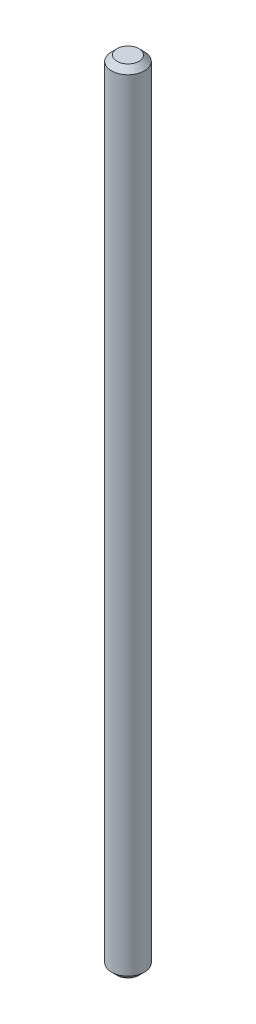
ISO-10303-21;
HEADER;
FILE_DESCRIPTION(('STEP AP214'),'2;1');
FILE_NAME('part.step','',(''),(''),'','','');
FILE_SCHEMA(('AUTOMOTIVE_DESIGN { 1 0 10303 214 1 1 1 1 }'));
ENDSEC;
DATA;
#1=APPLICATION_CONTEXT('core data for automotive mechanical design processes');
#2=APPLICATION_PROTOCOL_DEFINITION('international standard','automotive_design',2000,#1);
#3=PRODUCT_CONTEXT('',#1,'mechanical');
#4=PRODUCT('Part','Part','',(#3));
#5=PRODUCT_RELATED_PRODUCT_CATEGORY('part','',(#4));
#6=PRODUCT_DEFINITION_FORMATION('','',#4);
#7=PRODUCT_DEFINITION_CONTEXT('part definition',#1,'design');
#8=PRODUCT_DEFINITION('design','',#6,#7);
#9=PRODUCT_DEFINITION_SHAPE('','',#8);
#10=(LENGTH_UNIT() NAMED_UNIT(*) SI_UNIT(.MILLI.,.METRE.));
#11=(NAMED_UNIT(*) PLANE_ANGLE_UNIT() SI_UNIT($,.RADIAN.));
#12=(NAMED_UNIT(*) SI_UNIT($,.STERADIAN.) SOLID_ANGLE_UNIT());
#13=UNCERTAINTY_MEASURE_WITH_UNIT(LENGTH_MEASURE(1.E-05),#10,'distance_accuracy_value','');
#14=(GEOMETRIC_REPRESENTATION_CONTEXT(3) GLOBAL_UNCERTAINTY_ASSIGNED_CONTEXT((#13)) GLOBAL_UNIT_ASSIGNED_CONTEXT((#10,
#11,#12)) REPRESENTATION_CONTEXT('',''));
#15=CARTESIAN_POINT('',(0.,0.,0.));
#16=DIRECTION('',(0.,0.,1.));
#17=DIRECTION('',(1.,0.,0.));
#18=AXIS2_PLACEMENT_3D('',#15,#16,#17);
#19=CARTESIAN_POINT('',(0.,72.,0.));
#20=DIRECTION('',(0.,-1.,0.));
#21=DIRECTION('',(0.,0.,-1.));
#22=AXIS2_PLACEMENT_3D('',#19,#20,#21);
#23=CYLINDRICAL_SURFACE('',#22,1.5);
#24=CARTESIAN_POINT('',(0.,0.499999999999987,0.));
#25=DIRECTION('',(0.,1.,0.));
#26=DIRECTION('',(0.,0.,1.));
#27=AXIS2_PLACEMENT_3D('',#24,#25,#26);
#28=CIRCLE('',#27,1.5);
#29=CARTESIAN_POINT('',(0.,0.499999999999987,1.5));
#30=VERTEX_POINT('',#29);
#31=EDGE_CURVE('E40',#30,#30,#28,.T.);
#32=ORIENTED_EDGE('',*,*,#31,.T.);
#33=EDGE_LOOP('',(#32));
#34=FACE_BOUND('',#33,.T.);
#35=CARTESIAN_POINT('',(0.,71.5,0.));
#36=DIRECTION('',(0.,1.,0.));
#37=DIRECTION('',(0.,0.,1.));
#38=AXIS2_PLACEMENT_3D('',#35,#36,#37);
#39=CIRCLE('',#38,1.5);
#40=CARTESIAN_POINT('',(0.,71.5,1.5));
#41=VERTEX_POINT('',#40);
#42=EDGE_CURVE('E44',#41,#41,#39,.F.);
#43=ORIENTED_EDGE('',*,*,#42,.T.);
#44=EDGE_LOOP('',(#43));
#45=FACE_BOUND('',#44,.T.);
#46=ADVANCED_FACE('F29',(#34,#45),#23,.T.);
#47=CARTESIAN_POINT('',(0.,72.,0.));
#48=DIRECTION('',(0.,1.,0.));
#49=DIRECTION('',(0.,0.,1.));
#50=AXIS2_PLACEMENT_3D('',#47,#48,#49);
#51=PLANE('',#50);
#52=CARTESIAN_POINT('',(0.,72.,0.));
#53=DIRECTION('',(0.,1.,0.));
#54=DIRECTION('',(0.,0.,1.));
#55=AXIS2_PLACEMENT_3D('',#52,#53,#54);
#56=CIRCLE('',#55,1.00000000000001);
#57=CARTESIAN_POINT('',(0.,72.,1.00000000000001));
#58=VERTEX_POINT('',#57);
#59=EDGE_CURVE('E10',#58,#58,#56,.T.);
#60=ORIENTED_EDGE('',*,*,#59,.T.);
#61=EDGE_LOOP('',(#60));
#62=FACE_BOUND('',#61,.T.);
#63=ADVANCED_FACE('F60',(#62),#51,.T.);
#64=CARTESIAN_POINT('',(0.,0.,0.));
#65=DIRECTION('',(0.,1.,0.));
#66=DIRECTION('',(0.,0.,1.));
#67=AXIS2_PLACEMENT_3D('',#64,#65,#66);
#68=PLANE('',#67);
#69=CARTESIAN_POINT('',(0.,0.,0.));
#70=DIRECTION('',(0.,1.,0.));
#71=DIRECTION('',(0.,0.,1.));
#72=AXIS2_PLACEMENT_3D('',#69,#70,#71);
#73=CIRCLE('',#72,1.00000000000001);
#74=CARTESIAN_POINT('',(0.,0.,1.00000000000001));
#75=VERTEX_POINT('',#74);
#76=EDGE_CURVE('E36',#75,#75,#73,.F.);
#77=ORIENTED_EDGE('',*,*,#76,.T.);
#78=EDGE_LOOP('',(#77));
#79=FACE_BOUND('',#78,.T.);
#80=ADVANCED_FACE('F57',(#79),#68,.F.);
#81=CARTESIAN_POINT('',(0.,0.499999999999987,0.));
#82=DIRECTION('',(0.,1.,0.));
#83=DIRECTION('',(0.,0.,1.));
#84=AXIS2_PLACEMENT_3D('',#81,#82,#83);
#85=CONICAL_SURFACE('',#84,1.5,0.785398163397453);
#86=ORIENTED_EDGE('',*,*,#76,.F.);
#87=EDGE_LOOP('',(#86));
#88=FACE_BOUND('',#87,.T.);
#89=ORIENTED_EDGE('',*,*,#31,.F.);
#90=EDGE_LOOP('',(#89));
#91=FACE_BOUND('',#90,.T.);
#92=ADVANCED_FACE('F53',(#88,#91),#85,.T.);
#93=CARTESIAN_POINT('',(0.,72.,0.));
#94=DIRECTION('',(0.,-1.,0.));
#95=DIRECTION('',(0.,0.,-1.));
#96=AXIS2_PLACEMENT_3D('',#93,#94,#95);
#97=CONICAL_SURFACE('',#96,1.00000000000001,0.785398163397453);
#98=ORIENTED_EDGE('',*,*,#42,.F.);
#99=EDGE_LOOP('',(#98));
#100=FACE_BOUND('',#99,.T.);
#101=ORIENTED_EDGE('',*,*,#59,.F.);
#102=EDGE_LOOP('',(#101));
#103=FACE_BOUND('',#102,.T.);
#104=ADVANCED_FACE('F31',(#100,#103),#97,.T.);
#105=CLOSED_SHELL('',(#46,#63,#80,#92,#104));
#106=MANIFOLD_SOLID_BREP('B2',#105);
#107=ADVANCED_BREP_SHAPE_REPRESENTATION('',(#18,#106),#14);
#108=SHAPE_DEFINITION_REPRESENTATION(#9,#107);
ENDSEC;
END-ISO-10303-21;
